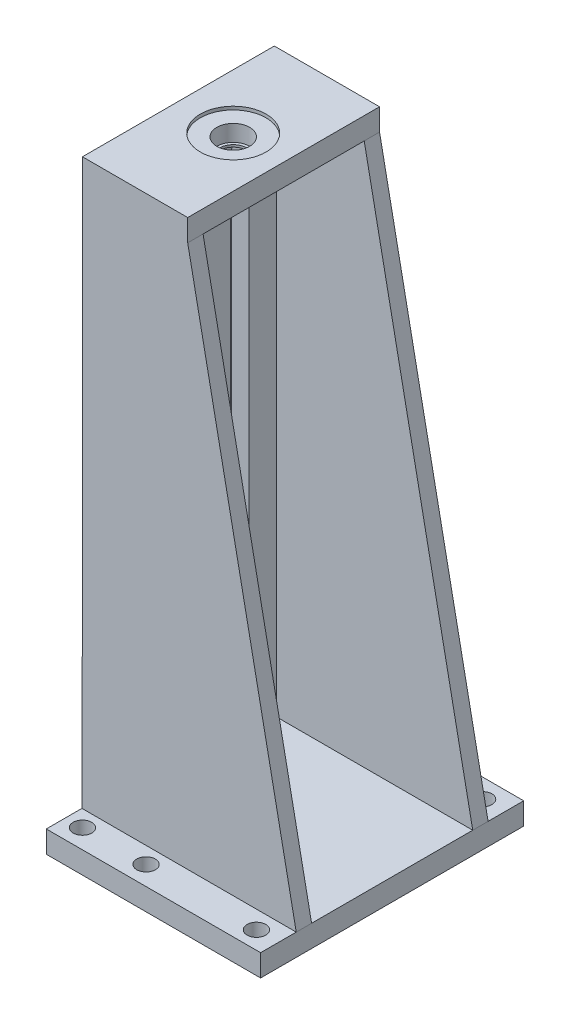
ISO-10303-21;
HEADER;
FILE_DESCRIPTION(('STEP AP214'),'2;1');
FILE_NAME('part.step','',(''),(''),'','','');
FILE_SCHEMA(('AUTOMOTIVE_DESIGN { 1 0 10303 214 1 1 1 1 }'));
ENDSEC;
DATA;
#1=APPLICATION_CONTEXT('core data for automotive mechanical design processes');
#2=APPLICATION_PROTOCOL_DEFINITION('international standard','automotive_design',2000,#1);
#3=PRODUCT_CONTEXT('',#1,'mechanical');
#4=PRODUCT('Part','Part','',(#3));
#5=PRODUCT_RELATED_PRODUCT_CATEGORY('part','',(#4));
#6=PRODUCT_DEFINITION_FORMATION('','',#4);
#7=PRODUCT_DEFINITION_CONTEXT('part definition',#1,'design');
#8=PRODUCT_DEFINITION('design','',#6,#7);
#9=PRODUCT_DEFINITION_SHAPE('','',#8);
#10=(LENGTH_UNIT() NAMED_UNIT(*) SI_UNIT(.MILLI.,.METRE.));
#11=(NAMED_UNIT(*) PLANE_ANGLE_UNIT() SI_UNIT($,.RADIAN.));
#12=(NAMED_UNIT(*) SI_UNIT($,.STERADIAN.) SOLID_ANGLE_UNIT());
#13=UNCERTAINTY_MEASURE_WITH_UNIT(LENGTH_MEASURE(1.E-05),#10,'distance_accuracy_value','');
#14=(GEOMETRIC_REPRESENTATION_CONTEXT(3) GLOBAL_UNCERTAINTY_ASSIGNED_CONTEXT((#13)) GLOBAL_UNIT_ASSIGNED_CONTEXT((#10,
#11,#12)) REPRESENTATION_CONTEXT('',''));
#15=CARTESIAN_POINT('',(0.,0.,0.));
#16=DIRECTION('',(0.,0.,1.));
#17=DIRECTION('',(1.,0.,0.));
#18=AXIS2_PLACEMENT_3D('',#15,#16,#17);
#19=CARTESIAN_POINT('',(50.,532.,0.));
#20=DIRECTION('',(0.,1.,0.));
#21=DIRECTION('',(0.,0.,1.));
#22=AXIS2_PLACEMENT_3D('',#19,#20,#21);
#23=CYLINDRICAL_SURFACE('',#22,15.);
#24=CARTESIAN_POINT('',(50.,517.,0.));
#25=DIRECTION('',(0.,1.,0.));
#26=DIRECTION('',(0.,0.,1.));
#27=AXIS2_PLACEMENT_3D('',#24,#25,#26);
#28=CIRCLE('',#27,15.);
#29=CARTESIAN_POINT('',(50.,517.,15.));
#30=VERTEX_POINT('',#29);
#31=EDGE_CURVE('E20',#30,#30,#28,.T.);
#32=ORIENTED_EDGE('',*,*,#31,.F.);
#33=EDGE_LOOP('',(#32));
#34=FACE_BOUND('',#33,.T.);
#35=CARTESIAN_POINT('',(50.,532.,0.));
#36=DIRECTION('',(0.,1.,0.));
#37=DIRECTION('',(0.,0.,1.));
#38=AXIS2_PLACEMENT_3D('',#35,#36,#37);
#39=CIRCLE('',#38,15.);
#40=CARTESIAN_POINT('',(50.,532.,15.));
#41=VERTEX_POINT('',#40);
#42=EDGE_CURVE('E384',#41,#41,#39,.F.);
#43=ORIENTED_EDGE('',*,*,#42,.F.);
#44=EDGE_LOOP('',(#43));
#45=FACE_BOUND('',#44,.T.);
#46=ADVANCED_FACE('F17',(#34,#45),#23,.F.);
#47=CARTESIAN_POINT('',(0.,517.,-120.));
#48=DIRECTION('',(0.,1.,0.));
#49=DIRECTION('',(0.,0.,1.));
#50=AXIS2_PLACEMENT_3D('',#47,#48,#49);
#51=PLANE('',#50);
#52=CARTESIAN_POINT('',(50.,517.,0.));
#53=DIRECTION('',(0.,1.,0.));
#54=DIRECTION('',(0.,0.,1.));
#55=AXIS2_PLACEMENT_3D('',#52,#53,#54);
#56=CIRCLE('',#55,12.5);
#57=CARTESIAN_POINT('',(50.,517.,12.5));
#58=VERTEX_POINT('',#57);
#59=EDGE_CURVE('E304',#58,#58,#56,.F.);
#60=ORIENTED_EDGE('',*,*,#59,.T.);
#61=EDGE_LOOP('',(#60));
#62=FACE_BOUND('',#61,.T.);
#63=ORIENTED_EDGE('',*,*,#31,.T.);
#64=EDGE_LOOP('',(#63));
#65=FACE_BOUND('',#64,.T.);
#66=ADVANCED_FACE('F391',(#62,#65),#51,.T.);
#67=CARTESIAN_POINT('',(0.,532.,-120.));
#68=DIRECTION('',(0.,1.,0.));
#69=DIRECTION('',(0.,0.,1.));
#70=AXIS2_PLACEMENT_3D('',#67,#68,#69);
#71=PLANE('',#70);
#72=ORIENTED_EDGE('',*,*,#42,.T.);
#73=EDGE_LOOP('',(#72));
#74=FACE_BOUND('',#73,.T.);
#75=CARTESIAN_POINT('',(50.,532.,0.));
#76=DIRECTION('',(0.,1.,0.));
#77=DIRECTION('',(0.,0.,1.));
#78=AXIS2_PLACEMENT_3D('',#75,#76,#77);
#79=CIRCLE('',#78,30.);
#80=CARTESIAN_POINT('',(50.,532.,30.));
#81=VERTEX_POINT('',#80);
#82=EDGE_CURVE('E277',#81,#81,#79,.T.);
#83=ORIENTED_EDGE('',*,*,#82,.T.);
#84=EDGE_LOOP('',(#83));
#85=FACE_BOUND('',#84,.T.);
#86=ADVANCED_FACE('F399',(#74,#85),#71,.T.);
#87=CARTESIAN_POINT('',(0.,20.,73.5));
#88=DIRECTION('',(0.,0.,1.));
#89=DIRECTION('',(1.,0.,0.));
#90=AXIS2_PLACEMENT_3D('',#87,#88,#89);
#91=PLANE('',#90);
#92=DIRECTION('',(1.,0.,0.));
#93=VECTOR('',#92,1.);
#94=CARTESIAN_POINT('',(0.,20.,73.5));
#95=LINE('',#94,#93);
#96=CARTESIAN_POINT('',(16.,20.,73.5));
#97=VERTEX_POINT('',#96);
#98=CARTESIAN_POINT('',(195.,20.,73.5));
#99=VERTEX_POINT('',#98);
#100=EDGE_CURVE('E296',#97,#99,#95,.T.);
#101=ORIENTED_EDGE('',*,*,#100,.F.);
#102=DIRECTION('',(0.,1.,0.));
#103=VECTOR('',#102,1.);
#104=CARTESIAN_POINT('',(16.,0.,73.5));
#105=LINE('',#104,#103);
#106=CARTESIAN_POINT('',(16.,515.,73.5));
#107=VERTEX_POINT('',#106);
#108=EDGE_CURVE('E291',#97,#107,#105,.T.);
#109=ORIENTED_EDGE('',*,*,#108,.T.);
#110=DIRECTION('',(1.,0.,0.));
#111=VECTOR('',#110,1.);
#112=CARTESIAN_POINT('',(0.,515.,73.5));
#113=LINE('',#112,#111);
#114=CARTESIAN_POINT('',(95.9999999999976,514.999999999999,73.5));
#115=VERTEX_POINT('',#114);
#116=EDGE_CURVE('E269',#107,#115,#113,.T.);
#117=ORIENTED_EDGE('',*,*,#116,.T.);
#118=DIRECTION('',(-0.196116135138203,0.980580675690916,0.));
#119=VECTOR('',#118,1.);
#120=CARTESIAN_POINT('',(195.,20.,73.5));
#121=LINE('',#120,#119);
#122=EDGE_CURVE('E274',#99,#115,#121,.T.);
#123=ORIENTED_EDGE('',*,*,#122,.F.);
#124=EDGE_LOOP('',(#101,#109,#117,#123));
#125=FACE_BOUND('',#124,.T.);
#126=ADVANCED_FACE('F557',(#125),#91,.F.);
#127=CARTESIAN_POINT('',(50.,532.,0.));
#128=DIRECTION('',(0.,1.,0.));
#129=DIRECTION('',(0.,0.,1.));
#130=AXIS2_PLACEMENT_3D('',#127,#128,#129);
#131=CYLINDRICAL_SURFACE('',#130,12.5);
#132=ORIENTED_EDGE('',*,*,#59,.F.);
#133=EDGE_LOOP('',(#132));
#134=FACE_BOUND('',#133,.T.);
#135=CARTESIAN_POINT('',(50.,515.,0.));
#136=DIRECTION('',(0.,1.,0.));
#137=DIRECTION('',(0.,0.,1.));
#138=AXIS2_PLACEMENT_3D('',#135,#136,#137);
#139=CIRCLE('',#138,12.5);
#140=CARTESIAN_POINT('',(50.,515.,12.5));
#141=VERTEX_POINT('',#140);
#142=EDGE_CURVE('E268',#141,#141,#139,.F.);
#143=ORIENTED_EDGE('',*,*,#142,.T.);
#144=EDGE_LOOP('',(#143));
#145=FACE_BOUND('',#144,.T.);
#146=ADVANCED_FACE('F553',(#134,#145),#131,.F.);
#147=CARTESIAN_POINT('',(0.,20.,0.));
#148=DIRECTION('',(0.,1.,0.));
#149=DIRECTION('',(0.,0.,1.));
#150=AXIS2_PLACEMENT_3D('',#147,#148,#149);
#151=PLANE('',#150);
#152=DIRECTION('',(0.,0.,-1.));
#153=VECTOR('',#152,1.);
#154=CARTESIAN_POINT('',(195.,20.,120.));
#155=LINE('',#154,#153);
#156=CARTESIAN_POINT('',(195.,20.,-73.5));
#157=VERTEX_POINT('',#156);
#158=EDGE_CURVE('E254',#157,#99,#155,.F.);
#159=ORIENTED_EDGE('',*,*,#158,.F.);
#160=DIRECTION('',(1.,0.,0.));
#161=VECTOR('',#160,1.);
#162=CARTESIAN_POINT('',(0.,20.,-73.5));
#163=LINE('',#162,#161);
#164=CARTESIAN_POINT('',(16.,20.,-73.5));
#165=VERTEX_POINT('',#164);
#166=EDGE_CURVE('E262',#165,#157,#163,.T.);
#167=ORIENTED_EDGE('',*,*,#166,.F.);
#168=DIRECTION('',(0.,0.,1.));
#169=VECTOR('',#168,1.);
#170=CARTESIAN_POINT('',(16.,20.,0.));
#171=LINE('',#170,#169);
#172=EDGE_CURVE('E293',#165,#97,#171,.T.);
#173=ORIENTED_EDGE('',*,*,#172,.T.);
#174=ORIENTED_EDGE('',*,*,#100,.T.);
#175=EDGE_LOOP('',(#159,#167,#173,#174));
#176=FACE_BOUND('',#175,.T.);
#177=ADVANCED_FACE('F549',(#176),#151,.T.);
#178=CARTESIAN_POINT('',(73.,20.,102.5));
#179=DIRECTION('',(0.,1.,0.));
#180=DIRECTION('',(0.,0.,1.));
#181=AXIS2_PLACEMENT_3D('',#178,#179,#180);
#182=CYLINDRICAL_SURFACE('',#181,8.5);
#183=CARTESIAN_POINT('',(73.,20.,102.5));
#184=DIRECTION('',(0.,1.,0.));
#185=DIRECTION('',(0.,0.,1.));
#186=AXIS2_PLACEMENT_3D('',#183,#184,#185);
#187=CIRCLE('',#186,8.5);
#188=CARTESIAN_POINT('',(73.,20.,111.));
#189=VERTEX_POINT('',#188);
#190=EDGE_CURVE('E247',#189,#189,#187,.F.);
#191=ORIENTED_EDGE('',*,*,#190,.F.);
#192=EDGE_LOOP('',(#191));
#193=FACE_BOUND('',#192,.T.);
#194=CARTESIAN_POINT('',(73.,0.,102.5));
#195=DIRECTION('',(0.,1.,0.));
#196=DIRECTION('',(0.,0.,1.));
#197=AXIS2_PLACEMENT_3D('',#194,#195,#196);
#198=CIRCLE('',#197,8.5);
#199=CARTESIAN_POINT('',(73.,0.,111.));
#200=VERTEX_POINT('',#199);
#201=EDGE_CURVE('E367',#200,#200,#198,.F.);
#202=ORIENTED_EDGE('',*,*,#201,.T.);
#203=EDGE_LOOP('',(#202));
#204=FACE_BOUND('',#203,.T.);
#205=ADVANCED_FACE('F545',(#193,#204),#182,.F.);
#206=CARTESIAN_POINT('',(15.,20.,102.5));
#207=DIRECTION('',(0.,1.,0.));
#208=DIRECTION('',(0.,0.,1.));
#209=AXIS2_PLACEMENT_3D('',#206,#207,#208);
#210=CYLINDRICAL_SURFACE('',#209,8.5);
#211=CARTESIAN_POINT('',(15.,20.,102.5));
#212=DIRECTION('',(0.,1.,0.));
#213=DIRECTION('',(0.,0.,1.));
#214=AXIS2_PLACEMENT_3D('',#211,#212,#213);
#215=CIRCLE('',#214,8.5);
#216=CARTESIAN_POINT('',(15.,20.,111.));
#217=VERTEX_POINT('',#216);
#218=EDGE_CURVE('E374',#217,#217,#215,.F.);
#219=ORIENTED_EDGE('',*,*,#218,.F.);
#220=EDGE_LOOP('',(#219));
#221=FACE_BOUND('',#220,.T.);
#222=CARTESIAN_POINT('',(15.,0.,102.5));
#223=DIRECTION('',(0.,1.,0.));
#224=DIRECTION('',(0.,0.,1.));
#225=AXIS2_PLACEMENT_3D('',#222,#223,#224);
#226=CIRCLE('',#225,8.5);
#227=CARTESIAN_POINT('',(15.,0.,111.));
#228=VERTEX_POINT('',#227);
#229=EDGE_CURVE('E361',#228,#228,#226,.F.);
#230=ORIENTED_EDGE('',*,*,#229,.T.);
#231=EDGE_LOOP('',(#230));
#232=FACE_BOUND('',#231,.T.);
#233=ADVANCED_FACE('F541',(#221,#232),#210,.F.);
#234=CARTESIAN_POINT('',(175.,20.,103.8173209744));
#235=DIRECTION('',(0.,1.,0.));
#236=DIRECTION('',(0.,0.,1.));
#237=AXIS2_PLACEMENT_3D('',#234,#235,#236);
#238=CYLINDRICAL_SURFACE('',#237,8.5);
#239=CARTESIAN_POINT('',(175.,20.,103.8173209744));
#240=DIRECTION('',(0.,1.,0.));
#241=DIRECTION('',(0.,0.,1.));
#242=AXIS2_PLACEMENT_3D('',#239,#240,#241);
#243=CIRCLE('',#242,8.5);
#244=CARTESIAN_POINT('',(175.,20.,112.3173209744));
#245=VERTEX_POINT('',#244);
#246=EDGE_CURVE('E243',#245,#245,#243,.F.);
#247=ORIENTED_EDGE('',*,*,#246,.F.);
#248=EDGE_LOOP('',(#247));
#249=FACE_BOUND('',#248,.T.);
#250=CARTESIAN_POINT('',(175.,0.,103.8173209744));
#251=DIRECTION('',(0.,1.,0.));
#252=DIRECTION('',(0.,0.,1.));
#253=AXIS2_PLACEMENT_3D('',#250,#251,#252);
#254=CIRCLE('',#253,8.5);
#255=CARTESIAN_POINT('',(175.,0.,112.3173209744));
#256=VERTEX_POINT('',#255);
#257=EDGE_CURVE('E231',#256,#256,#254,.F.);
#258=ORIENTED_EDGE('',*,*,#257,.T.);
#259=EDGE_LOOP('',(#258));
#260=FACE_BOUND('',#259,.T.);
#261=ADVANCED_FACE('F537',(#249,#260),#238,.F.);
#262=CARTESIAN_POINT('',(16.,0.,0.));
#263=DIRECTION('',(-1.,0.,0.));
#264=DIRECTION('',(0.,0.,1.));
#265=AXIS2_PLACEMENT_3D('',#262,#263,#264);
#266=PLANE('',#265);
#267=CARTESIAN_POINT('',(16.,185.,-40.));
#268=DIRECTION('',(-1.,0.,0.));
#269=DIRECTION('',(0.,0.,1.));
#270=AXIS2_PLACEMENT_3D('',#267,#268,#269);
#271=CIRCLE('',#270,8.5);
#272=CARTESIAN_POINT('',(16.,185.,-48.5));
#273=VERTEX_POINT('',#272);
#274=CARTESIAN_POINT('',(16.,185.,-31.5));
#275=VERTEX_POINT('',#274);
#276=EDGE_CURVE('E299',#273,#275,#271,.T.);
#277=ORIENTED_EDGE('',*,*,#276,.T.);
#278=DIRECTION('',(0.,1.,0.));
#279=VECTOR('',#278,1.);
#280=CARTESIAN_POINT('',(16.,185.,-31.5));
#281=LINE('',#280,#279);
#282=CARTESIAN_POINT('',(16.,485.,-31.5));
#283=VERTEX_POINT('',#282);
#284=EDGE_CURVE('E297',#283,#275,#281,.F.);
#285=ORIENTED_EDGE('',*,*,#284,.F.);
#286=CARTESIAN_POINT('',(16.,485.,-40.));
#287=DIRECTION('',(-1.,0.,0.));
#288=DIRECTION('',(0.,0.,1.));
#289=AXIS2_PLACEMENT_3D('',#286,#287,#288);
#290=CIRCLE('',#289,8.5);
#291=CARTESIAN_POINT('',(16.,485.,-48.5));
#292=VERTEX_POINT('',#291);
#293=EDGE_CURVE('E350',#283,#292,#290,.T.);
#294=ORIENTED_EDGE('',*,*,#293,.T.);
#295=DIRECTION('',(0.,1.,0.));
#296=VECTOR('',#295,1.);
#297=CARTESIAN_POINT('',(16.,485.,-48.5));
#298=LINE('',#297,#296);
#299=EDGE_CURVE('E286',#273,#292,#298,.T.);
#300=ORIENTED_EDGE('',*,*,#299,.F.);
#301=EDGE_LOOP('',(#277,#285,#294,#300));
#302=FACE_BOUND('',#301,.T.);
#303=CARTESIAN_POINT('',(16.,185.,40.));
#304=DIRECTION('',(1.,0.,0.));
#305=DIRECTION('',(0.,0.,-1.));
#306=AXIS2_PLACEMENT_3D('',#303,#304,#305);
#307=CIRCLE('',#306,8.5);
#308=CARTESIAN_POINT('',(16.,185.,31.5));
#309=VERTEX_POINT('',#308);
#310=CARTESIAN_POINT('',(16.,185.,48.5));
#311=VERTEX_POINT('',#310);
#312=EDGE_CURVE('E194',#309,#311,#307,.F.);
#313=ORIENTED_EDGE('',*,*,#312,.T.);
#314=DIRECTION('',(0.,1.,0.));
#315=VECTOR('',#314,1.);
#316=CARTESIAN_POINT('',(16.,485.,48.5));
#317=LINE('',#316,#315);
#318=CARTESIAN_POINT('',(16.,485.,48.5));
#319=VERTEX_POINT('',#318);
#320=EDGE_CURVE('E198',#311,#319,#317,.T.);
#321=ORIENTED_EDGE('',*,*,#320,.T.);
#322=CARTESIAN_POINT('',(16.,485.,40.));
#323=DIRECTION('',(1.,0.,0.));
#324=DIRECTION('',(0.,0.,-1.));
#325=AXIS2_PLACEMENT_3D('',#322,#323,#324);
#326=CIRCLE('',#325,8.5);
#327=CARTESIAN_POINT('',(16.,485.,31.5));
#328=VERTEX_POINT('',#327);
#329=EDGE_CURVE('E354',#319,#328,#326,.F.);
#330=ORIENTED_EDGE('',*,*,#329,.T.);
#331=DIRECTION('',(0.,1.,0.));
#332=VECTOR('',#331,1.);
#333=CARTESIAN_POINT('',(16.,185.,31.5));
#334=LINE('',#333,#332);
#335=EDGE_CURVE('E192',#328,#309,#334,.F.);
#336=ORIENTED_EDGE('',*,*,#335,.T.);
#337=EDGE_LOOP('',(#313,#321,#330,#336));
#338=FACE_BOUND('',#337,.T.);
#339=ORIENTED_EDGE('',*,*,#108,.F.);
#340=ORIENTED_EDGE('',*,*,#172,.F.);
#341=DIRECTION('',(0.,1.,0.));
#342=VECTOR('',#341,1.);
#343=CARTESIAN_POINT('',(16.,20.,-73.5));
#344=LINE('',#343,#342);
#345=CARTESIAN_POINT('',(16.,515.,-73.5));
#346=VERTEX_POINT('',#345);
#347=EDGE_CURVE('E265',#346,#165,#344,.F.);
#348=ORIENTED_EDGE('',*,*,#347,.F.);
#349=DIRECTION('',(0.,0.,1.));
#350=VECTOR('',#349,1.);
#351=CARTESIAN_POINT('',(16.,515.,0.));
#352=LINE('',#351,#350);
#353=EDGE_CURVE('E271',#346,#107,#352,.T.);
#354=ORIENTED_EDGE('',*,*,#353,.T.);
#355=EDGE_LOOP('',(#339,#340,#348,#354));
#356=FACE_BOUND('',#355,.T.);
#357=ADVANCED_FACE('F196',(#302,#338,#356),#266,.F.);
#358=CARTESIAN_POINT('',(-5.,0.,0.));
#359=DIRECTION('',(-1.,0.,0.));
#360=DIRECTION('',(0.,0.,1.));
#361=AXIS2_PLACEMENT_3D('',#358,#359,#360);
#362=PLANE('',#361);
#363=DIRECTION('',(0.,1.,0.));
#364=VECTOR('',#363,1.);
#365=CARTESIAN_POINT('',(-5.,220.,8.));
#366=LINE('',#365,#364);
#367=CARTESIAN_POINT('',(-5.,454.,8.));
#368=VERTEX_POINT('',#367);
#369=CARTESIAN_POINT('',(-5.,220.,8.));
#370=VERTEX_POINT('',#369);
#371=EDGE_CURVE('E278',#368,#370,#366,.F.);
#372=ORIENTED_EDGE('',*,*,#371,.F.);
#373=CARTESIAN_POINT('',(-5.,454.,0.));
#374=DIRECTION('',(-1.,0.,0.));
#375=DIRECTION('',(0.,0.,1.));
#376=AXIS2_PLACEMENT_3D('',#373,#374,#375);
#377=CIRCLE('',#376,8.);
#378=CARTESIAN_POINT('',(-5.,454.,-8.));
#379=VERTEX_POINT('',#378);
#380=EDGE_CURVE('E344',#379,#368,#377,.F.);
#381=ORIENTED_EDGE('',*,*,#380,.F.);
#382=DIRECTION('',(0.,1.,0.));
#383=VECTOR('',#382,1.);
#384=CARTESIAN_POINT('',(-5.,454.,-8.));
#385=LINE('',#384,#383);
#386=CARTESIAN_POINT('',(-5.,220.,-8.));
#387=VERTEX_POINT('',#386);
#388=EDGE_CURVE('E282',#387,#379,#385,.T.);
#389=ORIENTED_EDGE('',*,*,#388,.F.);
#390=CARTESIAN_POINT('',(-5.,220.,0.));
#391=DIRECTION('',(-1.,0.,0.));
#392=DIRECTION('',(0.,0.,1.));
#393=AXIS2_PLACEMENT_3D('',#390,#391,#392);
#394=CIRCLE('',#393,8.);
#395=EDGE_CURVE('E348',#370,#387,#394,.F.);
#396=ORIENTED_EDGE('',*,*,#395,.F.);
#397=EDGE_LOOP('',(#372,#381,#389,#396));
#398=FACE_BOUND('',#397,.T.);
#399=ADVANCED_FACE('F530',(#398),#362,.T.);
#400=CARTESIAN_POINT('',(50.,535.,0.));
#401=DIRECTION('',(0.,1.,0.));
#402=DIRECTION('',(0.,0.,1.));
#403=AXIS2_PLACEMENT_3D('',#400,#401,#402);
#404=CYLINDRICAL_SURFACE('',#403,30.);
#405=ORIENTED_EDGE('',*,*,#82,.F.);
#406=EDGE_LOOP('',(#405));
#407=FACE_BOUND('',#406,.T.);
#408=CARTESIAN_POINT('',(50.,535.,0.));
#409=DIRECTION('',(0.,1.,0.));
#410=DIRECTION('',(0.,0.,1.));
#411=AXIS2_PLACEMENT_3D('',#408,#409,#410);
#412=CIRCLE('',#411,30.);
#413=CARTESIAN_POINT('',(50.,535.,30.));
#414=VERTEX_POINT('',#413);
#415=EDGE_CURVE('E339',#414,#414,#412,.F.);
#416=ORIENTED_EDGE('',*,*,#415,.F.);
#417=EDGE_LOOP('',(#416));
#418=FACE_BOUND('',#417,.T.);
#419=ADVANCED_FACE('F526',(#407,#418),#404,.F.);
#420=CARTESIAN_POINT('',(195.,20.,87.5));
#421=DIRECTION('',(0.980580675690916,0.196116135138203,0.));
#422=DIRECTION('',(-0.196116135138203,0.980580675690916,0.));
#423=AXIS2_PLACEMENT_3D('',#420,#421,#422);
#424=PLANE('',#423);
#425=ORIENTED_EDGE('',*,*,#122,.T.);
#426=DIRECTION('',(0.,0.,-1.));
#427=VECTOR('',#426,1.);
#428=CARTESIAN_POINT('',(96.,515.,87.5));
#429=LINE('',#428,#427);
#430=CARTESIAN_POINT('',(95.9999999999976,515.,87.5));
#431=VERTEX_POINT('',#430);
#432=EDGE_CURVE('E590',#431,#115,#429,.T.);
#433=ORIENTED_EDGE('',*,*,#432,.F.);
#434=DIRECTION('',(-0.196116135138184,0.98058067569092,0.));
#435=VECTOR('',#434,1.);
#436=CARTESIAN_POINT('',(195.,20.,87.5));
#437=LINE('',#436,#435);
#438=CARTESIAN_POINT('',(195.,20.,87.5));
#439=VERTEX_POINT('',#438);
#440=EDGE_CURVE('E229',#439,#431,#437,.T.);
#441=ORIENTED_EDGE('',*,*,#440,.F.);
#442=DIRECTION('',(0.,0.,-1.));
#443=VECTOR('',#442,1.);
#444=CARTESIAN_POINT('',(195.,20.,120.));
#445=LINE('',#444,#443);
#446=EDGE_CURVE('E257',#99,#439,#445,.F.);
#447=ORIENTED_EDGE('',*,*,#446,.F.);
#448=EDGE_LOOP('',(#425,#433,#441,#447));
#449=FACE_BOUND('',#448,.T.);
#450=ADVANCED_FACE('F522',(#449),#424,.T.);
#451=CARTESIAN_POINT('',(0.,515.,0.));
#452=DIRECTION('',(0.,1.,0.));
#453=DIRECTION('',(0.,0.,1.));
#454=AXIS2_PLACEMENT_3D('',#451,#452,#453);
#455=PLANE('',#454);
#456=ORIENTED_EDGE('',*,*,#142,.F.);
#457=EDGE_LOOP('',(#456));
#458=FACE_BOUND('',#457,.T.);
#459=DIRECTION('',(0.,0.,-1.));
#460=VECTOR('',#459,1.);
#461=CARTESIAN_POINT('',(96.,515.,87.5));
#462=LINE('',#461,#460);
#463=CARTESIAN_POINT('',(95.9999999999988,515.,-73.5));
#464=VERTEX_POINT('',#463);
#465=EDGE_CURVE('E585',#115,#464,#462,.T.);
#466=ORIENTED_EDGE('',*,*,#465,.F.);
#467=ORIENTED_EDGE('',*,*,#116,.F.);
#468=ORIENTED_EDGE('',*,*,#353,.F.);
#469=DIRECTION('',(1.,0.,0.));
#470=VECTOR('',#469,1.);
#471=CARTESIAN_POINT('',(0.,515.,-73.5));
#472=LINE('',#471,#470);
#473=EDGE_CURVE('E259',#464,#346,#472,.F.);
#474=ORIENTED_EDGE('',*,*,#473,.F.);
#475=EDGE_LOOP('',(#466,#467,#468,#474));
#476=FACE_BOUND('',#475,.T.);
#477=ADVANCED_FACE('F518',(#458,#476),#455,.F.);
#478=CARTESIAN_POINT('',(0.,20.,-73.5));
#479=DIRECTION('',(0.,0.,1.));
#480=DIRECTION('',(1.,0.,0.));
#481=AXIS2_PLACEMENT_3D('',#478,#479,#480);
#482=PLANE('',#481);
#483=DIRECTION('',(0.196116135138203,-0.980580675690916,0.));
#484=VECTOR('',#483,1.);
#485=CARTESIAN_POINT('',(195.,20.,-73.5));
#486=LINE('',#485,#484);
#487=EDGE_CURVE('E650',#157,#464,#486,.F.);
#488=ORIENTED_EDGE('',*,*,#487,.T.);
#489=ORIENTED_EDGE('',*,*,#473,.T.);
#490=ORIENTED_EDGE('',*,*,#347,.T.);
#491=ORIENTED_EDGE('',*,*,#166,.T.);
#492=EDGE_LOOP('',(#488,#489,#490,#491));
#493=FACE_BOUND('',#492,.T.);
#494=ADVANCED_FACE('F514',(#493),#482,.T.);
#495=CARTESIAN_POINT('',(195.,0.,120.));
#496=DIRECTION('',(1.,0.,0.));
#497=DIRECTION('',(0.,0.,-1.));
#498=AXIS2_PLACEMENT_3D('',#495,#496,#497);
#499=PLANE('',#498);
#500=DIRECTION('',(0.,0.,1.));
#501=VECTOR('',#500,1.);
#502=CARTESIAN_POINT('',(195.,20.,-87.5));
#503=LINE('',#502,#501);
#504=CARTESIAN_POINT('',(195.,20.,-87.5));
#505=VERTEX_POINT('',#504);
#506=EDGE_CURVE('E587',#505,#157,#503,.T.);
#507=ORIENTED_EDGE('',*,*,#506,.T.);
#508=ORIENTED_EDGE('',*,*,#158,.T.);
#509=ORIENTED_EDGE('',*,*,#446,.T.);
#510=DIRECTION('',(0.,0.,1.));
#511=VECTOR('',#510,1.);
#512=CARTESIAN_POINT('',(195.,20.,0.));
#513=LINE('',#512,#511);
#514=CARTESIAN_POINT('',(195.,20.,120.));
#515=VERTEX_POINT('',#514);
#516=EDGE_CURVE('E248',#515,#439,#513,.F.);
#517=ORIENTED_EDGE('',*,*,#516,.F.);
#518=DIRECTION('',(0.,1.,0.));
#519=VECTOR('',#518,1.);
#520=CARTESIAN_POINT('',(195.,0.,120.));
#521=LINE('',#520,#519);
#522=CARTESIAN_POINT('',(195.,0.,120.));
#523=VERTEX_POINT('',#522);
#524=EDGE_CURVE('E251',#523,#515,#521,.T.);
#525=ORIENTED_EDGE('',*,*,#524,.F.);
#526=DIRECTION('',(0.,0.,1.));
#527=VECTOR('',#526,1.);
#528=CARTESIAN_POINT('',(195.,0.,0.));
#529=LINE('',#528,#527);
#530=CARTESIAN_POINT('',(195.,0.,-120.));
#531=VERTEX_POINT('',#530);
#532=EDGE_CURVE('E232',#523,#531,#529,.F.);
#533=ORIENTED_EDGE('',*,*,#532,.T.);
#534=DIRECTION('',(0.,1.,0.));
#535=VECTOR('',#534,1.);
#536=CARTESIAN_POINT('',(195.,0.,-120.));
#537=LINE('',#536,#535);
#538=CARTESIAN_POINT('',(195.,20.,-120.));
#539=VERTEX_POINT('',#538);
#540=EDGE_CURVE('E241',#539,#531,#537,.F.);
#541=ORIENTED_EDGE('',*,*,#540,.F.);
#542=DIRECTION('',(0.,0.,1.));
#543=VECTOR('',#542,1.);
#544=CARTESIAN_POINT('',(195.,20.,0.));
#545=LINE('',#544,#543);
#546=EDGE_CURVE('E647',#505,#539,#545,.F.);
#547=ORIENTED_EDGE('',*,*,#546,.F.);
#548=EDGE_LOOP('',(#507,#508,#509,#517,#525,#533,#541,#547));
#549=FACE_BOUND('',#548,.T.);
#550=ADVANCED_FACE('F510',(#549),#499,.T.);
#551=CARTESIAN_POINT('',(73.,20.,-102.5));
#552=DIRECTION('',(0.,1.,0.));
#553=DIRECTION('',(0.,0.,1.));
#554=AXIS2_PLACEMENT_3D('',#551,#552,#553);
#555=CYLINDRICAL_SURFACE('',#554,8.5);
#556=CARTESIAN_POINT('',(73.,20.,-102.5));
#557=DIRECTION('',(0.,1.,0.));
#558=DIRECTION('',(0.,0.,1.));
#559=AXIS2_PLACEMENT_3D('',#556,#557,#558);
#560=CIRCLE('',#559,8.5);
#561=CARTESIAN_POINT('',(73.,20.,-94.));
#562=VERTEX_POINT('',#561);
#563=EDGE_CURVE('E335',#562,#562,#560,.F.);
#564=ORIENTED_EDGE('',*,*,#563,.F.);
#565=EDGE_LOOP('',(#564));
#566=FACE_BOUND('',#565,.T.);
#567=CARTESIAN_POINT('',(73.,0.,-102.5));
#568=DIRECTION('',(0.,1.,0.));
#569=DIRECTION('',(0.,0.,1.));
#570=AXIS2_PLACEMENT_3D('',#567,#568,#569);
#571=CIRCLE('',#570,8.5);
#572=CARTESIAN_POINT('',(73.,0.,-94.));
#573=VERTEX_POINT('',#572);
#574=EDGE_CURVE('E235',#573,#573,#571,.F.);
#575=ORIENTED_EDGE('',*,*,#574,.T.);
#576=EDGE_LOOP('',(#575));
#577=FACE_BOUND('',#576,.T.);
#578=ADVANCED_FACE('F506',(#566,#577),#555,.F.);
#579=CARTESIAN_POINT('',(15.,20.,-102.5));
#580=DIRECTION('',(0.,1.,0.));
#581=DIRECTION('',(0.,0.,1.));
#582=AXIS2_PLACEMENT_3D('',#579,#580,#581);
#583=CYLINDRICAL_SURFACE('',#582,8.5);
#584=CARTESIAN_POINT('',(15.,20.,-102.5));
#585=DIRECTION('',(0.,1.,0.));
#586=DIRECTION('',(0.,0.,1.));
#587=AXIS2_PLACEMENT_3D('',#584,#585,#586);
#588=CIRCLE('',#587,8.5);
#589=CARTESIAN_POINT('',(15.,20.,-94.));
#590=VERTEX_POINT('',#589);
#591=EDGE_CURVE('E332',#590,#590,#588,.F.);
#592=ORIENTED_EDGE('',*,*,#591,.F.);
#593=EDGE_LOOP('',(#592));
#594=FACE_BOUND('',#593,.T.);
#595=CARTESIAN_POINT('',(15.,0.,-102.5));
#596=DIRECTION('',(0.,1.,0.));
#597=DIRECTION('',(0.,0.,1.));
#598=AXIS2_PLACEMENT_3D('',#595,#596,#597);
#599=CIRCLE('',#598,8.5);
#600=CARTESIAN_POINT('',(15.,0.,-94.));
#601=VERTEX_POINT('',#600);
#602=EDGE_CURVE('E364',#601,#601,#599,.F.);
#603=ORIENTED_EDGE('',*,*,#602,.T.);
#604=EDGE_LOOP('',(#603));
#605=FACE_BOUND('',#604,.T.);
#606=ADVANCED_FACE('F502',(#594,#605),#583,.F.);
#607=CARTESIAN_POINT('',(175.,20.,-102.5));
#608=DIRECTION('',(0.,1.,0.));
#609=DIRECTION('',(0.,0.,1.));
#610=AXIS2_PLACEMENT_3D('',#607,#608,#609);
#611=CYLINDRICAL_SURFACE('',#610,8.5);
#612=CARTESIAN_POINT('',(175.,20.,-102.5));
#613=DIRECTION('',(0.,1.,0.));
#614=DIRECTION('',(0.,0.,1.));
#615=AXIS2_PLACEMENT_3D('',#612,#613,#614);
#616=CIRCLE('',#615,8.5);
#617=CARTESIAN_POINT('',(175.,20.,-94.));
#618=VERTEX_POINT('',#617);
#619=EDGE_CURVE('E328',#618,#618,#616,.F.);
#620=ORIENTED_EDGE('',*,*,#619,.F.);
#621=EDGE_LOOP('',(#620));
#622=FACE_BOUND('',#621,.T.);
#623=CARTESIAN_POINT('',(175.,0.,-102.5));
#624=DIRECTION('',(0.,1.,0.));
#625=DIRECTION('',(0.,0.,1.));
#626=AXIS2_PLACEMENT_3D('',#623,#624,#625);
#627=CIRCLE('',#626,8.5);
#628=CARTESIAN_POINT('',(175.,0.,-94.));
#629=VERTEX_POINT('',#628);
#630=EDGE_CURVE('E358',#629,#629,#627,.F.);
#631=ORIENTED_EDGE('',*,*,#630,.T.);
#632=EDGE_LOOP('',(#631));
#633=FACE_BOUND('',#632,.T.);
#634=ADVANCED_FACE('F498',(#622,#633),#611,.F.);
#635=CARTESIAN_POINT('',(0.,0.,120.));
#636=DIRECTION('',(0.,0.,1.));
#637=DIRECTION('',(1.,0.,0.));
#638=AXIS2_PLACEMENT_3D('',#635,#636,#637);
#639=PLANE('',#638);
#640=DIRECTION('',(0.,1.,0.));
#641=VECTOR('',#640,1.);
#642=CARTESIAN_POINT('',(-0.5,0.,120.));
#643=LINE('',#642,#641);
#644=CARTESIAN_POINT('',(-0.5,0.,120.));
#645=VERTEX_POINT('',#644);
#646=CARTESIAN_POINT('',(-0.5,20.,120.));
#647=VERTEX_POINT('',#646);
#648=EDGE_CURVE('E331',#645,#647,#643,.T.);
#649=ORIENTED_EDGE('',*,*,#648,.F.);
#650=DIRECTION('',(1.,0.,0.));
#651=VECTOR('',#650,1.);
#652=CARTESIAN_POINT('',(0.,0.,120.));
#653=LINE('',#652,#651);
#654=EDGE_CURVE('E236',#645,#523,#653,.T.);
#655=ORIENTED_EDGE('',*,*,#654,.T.);
#656=ORIENTED_EDGE('',*,*,#524,.T.);
#657=DIRECTION('',(1.,0.,0.));
#658=VECTOR('',#657,1.);
#659=CARTESIAN_POINT('',(0.,20.,120.));
#660=LINE('',#659,#658);
#661=EDGE_CURVE('E244',#647,#515,#660,.T.);
#662=ORIENTED_EDGE('',*,*,#661,.F.);
#663=EDGE_LOOP('',(#649,#655,#656,#662));
#664=FACE_BOUND('',#663,.T.);
#665=ADVANCED_FACE('F494',(#664),#639,.T.);
#666=CARTESIAN_POINT('',(0.,20.,0.));
#667=DIRECTION('',(0.,1.,0.));
#668=DIRECTION('',(0.,0.,1.));
#669=AXIS2_PLACEMENT_3D('',#666,#667,#668);
#670=PLANE('',#669);
#671=ORIENTED_EDGE('',*,*,#246,.T.);
#672=EDGE_LOOP('',(#671));
#673=FACE_BOUND('',#672,.T.);
#674=ORIENTED_EDGE('',*,*,#218,.T.);
#675=EDGE_LOOP('',(#674));
#676=FACE_BOUND('',#675,.T.);
#677=ORIENTED_EDGE('',*,*,#190,.T.);
#678=EDGE_LOOP('',(#677));
#679=FACE_BOUND('',#678,.T.);
#680=DIRECTION('',(0.,0.,1.));
#681=VECTOR('',#680,1.);
#682=CARTESIAN_POINT('',(-0.5,20.,0.));
#683=LINE('',#682,#681);
#684=CARTESIAN_POINT('',(-0.5,20.,87.5));
#685=VERTEX_POINT('',#684);
#686=EDGE_CURVE('E641',#647,#685,#683,.F.);
#687=ORIENTED_EDGE('',*,*,#686,.F.);
#688=ORIENTED_EDGE('',*,*,#661,.T.);
#689=ORIENTED_EDGE('',*,*,#516,.T.);
#690=DIRECTION('',(1.,0.,0.));
#691=VECTOR('',#690,1.);
#692=CARTESIAN_POINT('',(0.,20.,87.5));
#693=LINE('',#692,#691);
#694=EDGE_CURVE('E226',#685,#439,#693,.T.);
#695=ORIENTED_EDGE('',*,*,#694,.F.);
#696=EDGE_LOOP('',(#687,#688,#689,#695));
#697=FACE_BOUND('',#696,.T.);
#698=ADVANCED_FACE('F490',(#673,#676,#679,#697),#670,.T.);
#699=CARTESIAN_POINT('',(195.,0.,-120.));
#700=DIRECTION('',(0.,0.,-1.));
#701=DIRECTION('',(-1.,0.,0.));
#702=AXIS2_PLACEMENT_3D('',#699,#700,#701);
#703=PLANE('',#702);
#704=DIRECTION('',(0.,1.,0.));
#705=VECTOR('',#704,1.);
#706=CARTESIAN_POINT('',(-0.5,0.,-120.));
#707=LINE('',#706,#705);
#708=CARTESIAN_POINT('',(-0.5,20.,-120.));
#709=VERTEX_POINT('',#708);
#710=CARTESIAN_POINT('',(-0.5,0.,-120.));
#711=VERTEX_POINT('',#710);
#712=EDGE_CURVE('E629',#709,#711,#707,.F.);
#713=ORIENTED_EDGE('',*,*,#712,.F.);
#714=DIRECTION('',(1.,0.,0.));
#715=VECTOR('',#714,1.);
#716=CARTESIAN_POINT('',(0.,20.,-120.));
#717=LINE('',#716,#715);
#718=EDGE_CURVE('E338',#539,#709,#717,.F.);
#719=ORIENTED_EDGE('',*,*,#718,.F.);
#720=ORIENTED_EDGE('',*,*,#540,.T.);
#721=DIRECTION('',(1.,0.,0.));
#722=VECTOR('',#721,1.);
#723=CARTESIAN_POINT('',(0.,0.,-120.));
#724=LINE('',#723,#722);
#725=EDGE_CURVE('E239',#531,#711,#724,.F.);
#726=ORIENTED_EDGE('',*,*,#725,.T.);
#727=EDGE_LOOP('',(#713,#719,#720,#726));
#728=FACE_BOUND('',#727,.T.);
#729=ADVANCED_FACE('F486',(#728),#703,.T.);
#730=CARTESIAN_POINT('',(0.,0.,0.));
#731=DIRECTION('',(0.,1.,0.));
#732=DIRECTION('',(0.,0.,1.));
#733=AXIS2_PLACEMENT_3D('',#730,#731,#732);
#734=PLANE('',#733);
#735=ORIENTED_EDGE('',*,*,#257,.F.);
#736=EDGE_LOOP('',(#735));
#737=FACE_BOUND('',#736,.T.);
#738=ORIENTED_EDGE('',*,*,#630,.F.);
#739=EDGE_LOOP('',(#738));
#740=FACE_BOUND('',#739,.T.);
#741=ORIENTED_EDGE('',*,*,#229,.F.);
#742=EDGE_LOOP('',(#741));
#743=FACE_BOUND('',#742,.T.);
#744=ORIENTED_EDGE('',*,*,#602,.F.);
#745=EDGE_LOOP('',(#744));
#746=FACE_BOUND('',#745,.T.);
#747=ORIENTED_EDGE('',*,*,#201,.F.);
#748=EDGE_LOOP('',(#747));
#749=FACE_BOUND('',#748,.T.);
#750=ORIENTED_EDGE('',*,*,#574,.F.);
#751=EDGE_LOOP('',(#750));
#752=FACE_BOUND('',#751,.T.);
#753=ORIENTED_EDGE('',*,*,#654,.F.);
#754=DIRECTION('',(0.,0.,1.));
#755=VECTOR('',#754,1.);
#756=CARTESIAN_POINT('',(-0.5,0.,0.));
#757=LINE('',#756,#755);
#758=EDGE_CURVE('E626',#711,#645,#757,.T.);
#759=ORIENTED_EDGE('',*,*,#758,.F.);
#760=ORIENTED_EDGE('',*,*,#725,.F.);
#761=ORIENTED_EDGE('',*,*,#532,.F.);
#762=EDGE_LOOP('',(#753,#759,#760,#761));
#763=FACE_BOUND('',#762,.T.);
#764=ADVANCED_FACE('F482',(#737,#740,#743,#746,#749,#752,#763),#734,.F.);
#765=CARTESIAN_POINT('',(0.,20.,87.5));
#766=DIRECTION('',(0.,0.,1.));
#767=DIRECTION('',(1.,0.,0.));
#768=AXIS2_PLACEMENT_3D('',#765,#766,#767);
#769=PLANE('',#768);
#770=DIRECTION('',(0.,1.,0.));
#771=VECTOR('',#770,1.);
#772=CARTESIAN_POINT('',(-0.5,0.,87.5));
#773=LINE('',#772,#771);
#774=CARTESIAN_POINT('',(-0.5,140.,87.5));
#775=VERTEX_POINT('',#774);
#776=EDGE_CURVE('E638',#685,#775,#773,.T.);
#777=ORIENTED_EDGE('',*,*,#776,.F.);
#778=ORIENTED_EDGE('',*,*,#694,.T.);
#779=ORIENTED_EDGE('',*,*,#440,.T.);
#780=DIRECTION('',(0.,1.,0.));
#781=VECTOR('',#780,1.);
#782=CARTESIAN_POINT('',(96.,515.,87.5));
#783=LINE('',#782,#781);
#784=CARTESIAN_POINT('',(96.,535.,87.5));
#785=VERTEX_POINT('',#784);
#786=EDGE_CURVE('E342',#785,#431,#783,.F.);
#787=ORIENTED_EDGE('',*,*,#786,.F.);
#788=DIRECTION('',(1.,0.,0.));
#789=VECTOR('',#788,1.);
#790=CARTESIAN_POINT('',(0.,535.,87.5));
#791=LINE('',#790,#789);
#792=CARTESIAN_POINT('',(0.,535.,87.5));
#793=VERTEX_POINT('',#792);
#794=EDGE_CURVE('E343',#793,#785,#791,.T.);
#795=ORIENTED_EDGE('',*,*,#794,.F.);
#796=DIRECTION('',(0.,1.,0.));
#797=VECTOR('',#796,1.);
#798=CARTESIAN_POINT('',(0.,0.,87.5));
#799=LINE('',#798,#797);
#800=CARTESIAN_POINT('',(0.,140.,87.5));
#801=VERTEX_POINT('',#800);
#802=EDGE_CURVE('E624',#801,#793,#799,.T.);
#803=ORIENTED_EDGE('',*,*,#802,.F.);
#804=DIRECTION('',(1.,0.,0.));
#805=VECTOR('',#804,1.);
#806=CARTESIAN_POINT('',(0.,140.,87.5));
#807=LINE('',#806,#805);
#808=EDGE_CURVE('E211',#775,#801,#807,.T.);
#809=ORIENTED_EDGE('',*,*,#808,.F.);
#810=EDGE_LOOP('',(#777,#778,#779,#787,#795,#803,#809));
#811=FACE_BOUND('',#810,.T.);
#812=ADVANCED_FACE('F478',(#811),#769,.T.);
#813=CARTESIAN_POINT('',(0.,140.,87.5));
#814=DIRECTION('',(0.,1.,0.));
#815=DIRECTION('',(0.,0.,1.));
#816=AXIS2_PLACEMENT_3D('',#813,#814,#815);
#817=PLANE('',#816);
#818=ORIENTED_EDGE('',*,*,#808,.T.);
#819=DIRECTION('',(0.,0.,1.));
#820=VECTOR('',#819,1.);
#821=CARTESIAN_POINT('',(0.,140.,-120.));
#822=LINE('',#821,#820);
#823=CARTESIAN_POINT('',(0.,140.,-87.5));
#824=VERTEX_POINT('',#823);
#825=EDGE_CURVE('E617',#824,#801,#822,.T.);
#826=ORIENTED_EDGE('',*,*,#825,.F.);
#827=DIRECTION('',(1.,0.,0.));
#828=VECTOR('',#827,1.);
#829=CARTESIAN_POINT('',(0.,140.,-87.5));
#830=LINE('',#829,#828);
#831=CARTESIAN_POINT('',(-0.5,140.,-87.5));
#832=VERTEX_POINT('',#831);
#833=EDGE_CURVE('E34',#824,#832,#830,.F.);
#834=ORIENTED_EDGE('',*,*,#833,.T.);
#835=DIRECTION('',(0.,0.,1.));
#836=VECTOR('',#835,1.);
#837=CARTESIAN_POINT('',(-0.5,140.,0.));
#838=LINE('',#837,#836);
#839=EDGE_CURVE('E635',#775,#832,#838,.F.);
#840=ORIENTED_EDGE('',*,*,#839,.F.);
#841=EDGE_LOOP('',(#818,#826,#834,#840));
#842=FACE_BOUND('',#841,.T.);
#843=ADVANCED_FACE('F475',(#842),#817,.T.);
#844=CARTESIAN_POINT('',(16.,485.,48.5));
#845=DIRECTION('',(0.,0.,1.));
#846=DIRECTION('',(1.,0.,0.));
#847=AXIS2_PLACEMENT_3D('',#844,#845,#846);
#848=PLANE('',#847);
#849=ORIENTED_EDGE('',*,*,#320,.F.);
#850=DIRECTION('',(1.,0.,0.));
#851=VECTOR('',#850,1.);
#852=CARTESIAN_POINT('',(16.,185.,48.5));
#853=LINE('',#852,#851);
#854=CARTESIAN_POINT('',(0.,185.,48.5));
#855=VERTEX_POINT('',#854);
#856=EDGE_CURVE('E203',#311,#855,#853,.F.);
#857=ORIENTED_EDGE('',*,*,#856,.T.);
#858=DIRECTION('',(0.,1.,0.));
#859=VECTOR('',#858,1.);
#860=CARTESIAN_POINT('',(0.,0.,48.5));
#861=LINE('',#860,#859);
#862=CARTESIAN_POINT('',(0.,485.,48.5));
#863=VERTEX_POINT('',#862);
#864=EDGE_CURVE('E327',#863,#855,#861,.F.);
#865=ORIENTED_EDGE('',*,*,#864,.F.);
#866=DIRECTION('',(1.,0.,0.));
#867=VECTOR('',#866,1.);
#868=CARTESIAN_POINT('',(16.,485.,48.5));
#869=LINE('',#868,#867);
#870=EDGE_CURVE('E209',#863,#319,#869,.T.);
#871=ORIENTED_EDGE('',*,*,#870,.T.);
#872=EDGE_LOOP('',(#849,#857,#865,#871));
#873=FACE_BOUND('',#872,.T.);
#874=ADVANCED_FACE('F206',(#873),#848,.F.);
#875=CARTESIAN_POINT('',(16.,185.,40.));
#876=DIRECTION('',(1.,0.,0.));
#877=DIRECTION('',(0.,0.,-1.));
#878=AXIS2_PLACEMENT_3D('',#875,#876,#877);
#879=CYLINDRICAL_SURFACE('',#878,8.5);
#880=ORIENTED_EDGE('',*,*,#312,.F.);
#881=DIRECTION('',(-1.,0.,0.));
#882=VECTOR('',#881,1.);
#883=CARTESIAN_POINT('',(16.,185.,31.5));
#884=LINE('',#883,#882);
#885=CARTESIAN_POINT('',(0.,185.,31.5));
#886=VERTEX_POINT('',#885);
#887=EDGE_CURVE('E218',#309,#886,#884,.T.);
#888=ORIENTED_EDGE('',*,*,#887,.T.);
#889=CARTESIAN_POINT('',(0.,185.,40.));
#890=DIRECTION('',(1.,0.,0.));
#891=DIRECTION('',(0.,0.,-1.));
#892=AXIS2_PLACEMENT_3D('',#889,#890,#891);
#893=CIRCLE('',#892,8.5);
#894=EDGE_CURVE('E215',#855,#886,#893,.T.);
#895=ORIENTED_EDGE('',*,*,#894,.F.);
#896=ORIENTED_EDGE('',*,*,#856,.F.);
#897=EDGE_LOOP('',(#880,#888,#895,#896));
#898=FACE_BOUND('',#897,.T.);
#899=ADVANCED_FACE('F213',(#898),#879,.F.);
#900=CARTESIAN_POINT('',(16.,185.,31.5));
#901=DIRECTION('',(0.,0.,-1.));
#902=DIRECTION('',(-1.,0.,0.));
#903=AXIS2_PLACEMENT_3D('',#900,#901,#902);
#904=PLANE('',#903);
#905=ORIENTED_EDGE('',*,*,#335,.F.);
#906=DIRECTION('',(1.,0.,0.));
#907=VECTOR('',#906,1.);
#908=CARTESIAN_POINT('',(16.,485.,31.5));
#909=LINE('',#908,#907);
#910=CARTESIAN_POINT('',(0.,485.,31.5));
#911=VERTEX_POINT('',#910);
#912=EDGE_CURVE('E300',#328,#911,#909,.F.);
#913=ORIENTED_EDGE('',*,*,#912,.T.);
#914=DIRECTION('',(0.,1.,0.));
#915=VECTOR('',#914,1.);
#916=CARTESIAN_POINT('',(0.,0.,31.5));
#917=LINE('',#916,#915);
#918=EDGE_CURVE('E325',#886,#911,#917,.T.);
#919=ORIENTED_EDGE('',*,*,#918,.F.);
#920=ORIENTED_EDGE('',*,*,#887,.F.);
#921=EDGE_LOOP('',(#905,#913,#919,#920));
#922=FACE_BOUND('',#921,.T.);
#923=ADVANCED_FACE('F466',(#922),#904,.F.);
#924=CARTESIAN_POINT('',(16.,485.,40.));
#925=DIRECTION('',(1.,0.,0.));
#926=DIRECTION('',(0.,0.,-1.));
#927=AXIS2_PLACEMENT_3D('',#924,#925,#926);
#928=CYLINDRICAL_SURFACE('',#927,8.5);
#929=ORIENTED_EDGE('',*,*,#329,.F.);
#930=ORIENTED_EDGE('',*,*,#870,.F.);
#931=CARTESIAN_POINT('',(0.,485.,40.));
#932=DIRECTION('',(1.,0.,0.));
#933=DIRECTION('',(0.,0.,-1.));
#934=AXIS2_PLACEMENT_3D('',#931,#932,#933);
#935=CIRCLE('',#934,8.5);
#936=EDGE_CURVE('E322',#911,#863,#935,.T.);
#937=ORIENTED_EDGE('',*,*,#936,.F.);
#938=ORIENTED_EDGE('',*,*,#912,.F.);
#939=EDGE_LOOP('',(#929,#930,#937,#938));
#940=FACE_BOUND('',#939,.T.);
#941=ADVANCED_FACE('F462',(#940),#928,.F.);
#942=CARTESIAN_POINT('',(16.,185.,-31.5));
#943=DIRECTION('',(0.,0.,-1.));
#944=DIRECTION('',(-1.,0.,0.));
#945=AXIS2_PLACEMENT_3D('',#942,#943,#944);
#946=PLANE('',#945);
#947=DIRECTION('',(0.,1.,0.));
#948=VECTOR('',#947,1.);
#949=CARTESIAN_POINT('',(0.,0.,-31.5));
#950=LINE('',#949,#948);
#951=CARTESIAN_POINT('',(0.,485.,-31.5));
#952=VERTEX_POINT('',#951);
#953=CARTESIAN_POINT('',(0.,185.,-31.5));
#954=VERTEX_POINT('',#953);
#955=EDGE_CURVE('E321',#952,#954,#950,.F.);
#956=ORIENTED_EDGE('',*,*,#955,.F.);
#957=DIRECTION('',(-1.,0.,0.));
#958=VECTOR('',#957,1.);
#959=CARTESIAN_POINT('',(16.,485.,-31.5));
#960=LINE('',#959,#958);
#961=EDGE_CURVE('E289',#952,#283,#960,.F.);
#962=ORIENTED_EDGE('',*,*,#961,.T.);
#963=ORIENTED_EDGE('',*,*,#284,.T.);
#964=DIRECTION('',(-1.,0.,0.));
#965=VECTOR('',#964,1.);
#966=CARTESIAN_POINT('',(16.,185.,-31.5));
#967=LINE('',#966,#965);
#968=EDGE_CURVE('E353',#275,#954,#967,.T.);
#969=ORIENTED_EDGE('',*,*,#968,.T.);
#970=EDGE_LOOP('',(#956,#962,#963,#969));
#971=FACE_BOUND('',#970,.T.);
#972=ADVANCED_FACE('F458',(#971),#946,.T.);
#973=CARTESIAN_POINT('',(16.,185.,-40.));
#974=DIRECTION('',(-1.,0.,0.));
#975=DIRECTION('',(0.,0.,1.));
#976=AXIS2_PLACEMENT_3D('',#973,#974,#975);
#977=CYLINDRICAL_SURFACE('',#976,8.5);
#978=ORIENTED_EDGE('',*,*,#968,.F.);
#979=ORIENTED_EDGE('',*,*,#276,.F.);
#980=DIRECTION('',(1.,0.,0.));
#981=VECTOR('',#980,1.);
#982=CARTESIAN_POINT('',(16.,185.,-48.5));
#983=LINE('',#982,#981);
#984=CARTESIAN_POINT('',(0.,185.,-48.5));
#985=VERTEX_POINT('',#984);
#986=EDGE_CURVE('E290',#985,#273,#983,.T.);
#987=ORIENTED_EDGE('',*,*,#986,.F.);
#988=CARTESIAN_POINT('',(0.,185.,-40.));
#989=DIRECTION('',(-1.,0.,0.));
#990=DIRECTION('',(0.,0.,1.));
#991=AXIS2_PLACEMENT_3D('',#988,#989,#990);
#992=CIRCLE('',#991,8.5);
#993=EDGE_CURVE('E318',#954,#985,#992,.F.);
#994=ORIENTED_EDGE('',*,*,#993,.F.);
#995=EDGE_LOOP('',(#978,#979,#987,#994));
#996=FACE_BOUND('',#995,.T.);
#997=ADVANCED_FACE('F454',(#996),#977,.F.);
#998=CARTESIAN_POINT('',(16.,485.,-48.5));
#999=DIRECTION('',(0.,0.,1.));
#1000=DIRECTION('',(1.,0.,0.));
#1001=AXIS2_PLACEMENT_3D('',#998,#999,#1000);
#1002=PLANE('',#1001);
#1003=ORIENTED_EDGE('',*,*,#299,.T.);
#1004=DIRECTION('',(-1.,0.,0.));
#1005=VECTOR('',#1004,1.);
#1006=CARTESIAN_POINT('',(16.,485.,-48.5));
#1007=LINE('',#1006,#1005);
#1008=CARTESIAN_POINT('',(0.,485.,-48.5));
#1009=VERTEX_POINT('',#1008);
#1010=EDGE_CURVE('E281',#292,#1009,#1007,.T.);
#1011=ORIENTED_EDGE('',*,*,#1010,.T.);
#1012=DIRECTION('',(0.,1.,0.));
#1013=VECTOR('',#1012,1.);
#1014=CARTESIAN_POINT('',(0.,0.,-48.5));
#1015=LINE('',#1014,#1013);
#1016=EDGE_CURVE('E317',#985,#1009,#1015,.T.);
#1017=ORIENTED_EDGE('',*,*,#1016,.F.);
#1018=ORIENTED_EDGE('',*,*,#986,.T.);
#1019=EDGE_LOOP('',(#1003,#1011,#1017,#1018));
#1020=FACE_BOUND('',#1019,.T.);
#1021=ADVANCED_FACE('F450',(#1020),#1002,.T.);
#1022=CARTESIAN_POINT('',(16.,485.,-40.));
#1023=DIRECTION('',(-1.,0.,0.));
#1024=DIRECTION('',(0.,0.,1.));
#1025=AXIS2_PLACEMENT_3D('',#1022,#1023,#1024);
#1026=CYLINDRICAL_SURFACE('',#1025,8.5);
#1027=ORIENTED_EDGE('',*,*,#1010,.F.);
#1028=ORIENTED_EDGE('',*,*,#293,.F.);
#1029=ORIENTED_EDGE('',*,*,#961,.F.);
#1030=CARTESIAN_POINT('',(0.,485.,-40.));
#1031=DIRECTION('',(-1.,0.,0.));
#1032=DIRECTION('',(0.,0.,1.));
#1033=AXIS2_PLACEMENT_3D('',#1030,#1031,#1032);
#1034=CIRCLE('',#1033,8.5);
#1035=EDGE_CURVE('E314',#1009,#952,#1034,.F.);
#1036=ORIENTED_EDGE('',*,*,#1035,.F.);
#1037=EDGE_LOOP('',(#1027,#1028,#1029,#1036));
#1038=FACE_BOUND('',#1037,.T.);
#1039=ADVANCED_FACE('F446',(#1038),#1026,.F.);
#1040=CARTESIAN_POINT('',(0.,220.,8.));
#1041=DIRECTION('',(0.,0.,1.));
#1042=DIRECTION('',(1.,0.,0.));
#1043=AXIS2_PLACEMENT_3D('',#1040,#1041,#1042);
#1044=PLANE('',#1043);
#1045=DIRECTION('',(-1.,0.,0.));
#1046=VECTOR('',#1045,1.);
#1047=CARTESIAN_POINT('',(0.,220.,8.));
#1048=LINE('',#1047,#1046);
#1049=CARTESIAN_POINT('',(0.,220.,8.));
#1050=VERTEX_POINT('',#1049);
#1051=EDGE_CURVE('E280',#1050,#370,#1048,.T.);
#1052=ORIENTED_EDGE('',*,*,#1051,.F.);
#1053=DIRECTION('',(0.,1.,0.));
#1054=VECTOR('',#1053,1.);
#1055=CARTESIAN_POINT('',(0.,0.,8.00000000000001));
#1056=LINE('',#1055,#1054);
#1057=CARTESIAN_POINT('',(0.,454.,8.));
#1058=VERTEX_POINT('',#1057);
#1059=EDGE_CURVE('E313',#1058,#1050,#1056,.F.);
#1060=ORIENTED_EDGE('',*,*,#1059,.F.);
#1061=DIRECTION('',(-1.,0.,0.));
#1062=VECTOR('',#1061,1.);
#1063=CARTESIAN_POINT('',(0.,454.,8.));
#1064=LINE('',#1063,#1062);
#1065=EDGE_CURVE('E347',#368,#1058,#1064,.F.);
#1066=ORIENTED_EDGE('',*,*,#1065,.F.);
#1067=ORIENTED_EDGE('',*,*,#371,.T.);
#1068=EDGE_LOOP('',(#1052,#1060,#1066,#1067));
#1069=FACE_BOUND('',#1068,.T.);
#1070=ADVANCED_FACE('F442',(#1069),#1044,.T.);
#1071=CARTESIAN_POINT('',(0.,220.,0.));
#1072=DIRECTION('',(-1.,0.,0.));
#1073=DIRECTION('',(0.,0.,1.));
#1074=AXIS2_PLACEMENT_3D('',#1071,#1072,#1073);
#1075=CYLINDRICAL_SURFACE('',#1074,8.);
#1076=DIRECTION('',(-1.,0.,0.));
#1077=VECTOR('',#1076,1.);
#1078=CARTESIAN_POINT('',(0.,220.,-8.));
#1079=LINE('',#1078,#1077);
#1080=CARTESIAN_POINT('',(0.,220.,-8.));
#1081=VERTEX_POINT('',#1080);
#1082=EDGE_CURVE('E285',#1081,#387,#1079,.T.);
#1083=ORIENTED_EDGE('',*,*,#1082,.F.);
#1084=CARTESIAN_POINT('',(0.,220.,0.));
#1085=DIRECTION('',(-1.,0.,0.));
#1086=DIRECTION('',(0.,0.,1.));
#1087=AXIS2_PLACEMENT_3D('',#1084,#1085,#1086);
#1088=CIRCLE('',#1087,8.);
#1089=EDGE_CURVE('E310',#1050,#1081,#1088,.F.);
#1090=ORIENTED_EDGE('',*,*,#1089,.F.);
#1091=ORIENTED_EDGE('',*,*,#1051,.T.);
#1092=ORIENTED_EDGE('',*,*,#395,.T.);
#1093=EDGE_LOOP('',(#1083,#1090,#1091,#1092));
#1094=FACE_BOUND('',#1093,.T.);
#1095=ADVANCED_FACE('F438',(#1094),#1075,.T.);
#1096=CARTESIAN_POINT('',(0.,454.,-8.));
#1097=DIRECTION('',(0.,0.,-1.));
#1098=DIRECTION('',(-1.,0.,0.));
#1099=AXIS2_PLACEMENT_3D('',#1096,#1097,#1098);
#1100=PLANE('',#1099);
#1101=DIRECTION('',(-1.,0.,0.));
#1102=VECTOR('',#1101,1.);
#1103=CARTESIAN_POINT('',(0.,454.,-8.));
#1104=LINE('',#1103,#1102);
#1105=CARTESIAN_POINT('',(0.,454.,-8.));
#1106=VERTEX_POINT('',#1105);
#1107=EDGE_CURVE('E284',#1106,#379,#1104,.T.);
#1108=ORIENTED_EDGE('',*,*,#1107,.F.);
#1109=DIRECTION('',(0.,1.,0.));
#1110=VECTOR('',#1109,1.);
#1111=CARTESIAN_POINT('',(0.,0.,-8.00000000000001));
#1112=LINE('',#1111,#1110);
#1113=EDGE_CURVE('E309',#1081,#1106,#1112,.T.);
#1114=ORIENTED_EDGE('',*,*,#1113,.F.);
#1115=ORIENTED_EDGE('',*,*,#1082,.T.);
#1116=ORIENTED_EDGE('',*,*,#388,.T.);
#1117=EDGE_LOOP('',(#1108,#1114,#1115,#1116));
#1118=FACE_BOUND('',#1117,.T.);
#1119=ADVANCED_FACE('F434',(#1118),#1100,.T.);
#1120=CARTESIAN_POINT('',(0.,454.,0.));
#1121=DIRECTION('',(-1.,0.,0.));
#1122=DIRECTION('',(0.,0.,1.));
#1123=AXIS2_PLACEMENT_3D('',#1120,#1121,#1122);
#1124=CYLINDRICAL_SURFACE('',#1123,8.);
#1125=ORIENTED_EDGE('',*,*,#1065,.T.);
#1126=CARTESIAN_POINT('',(0.,454.,0.));
#1127=DIRECTION('',(-1.,0.,0.));
#1128=DIRECTION('',(0.,0.,1.));
#1129=AXIS2_PLACEMENT_3D('',#1126,#1127,#1128);
#1130=CIRCLE('',#1129,8.);
#1131=EDGE_CURVE('E305',#1106,#1058,#1130,.F.);
#1132=ORIENTED_EDGE('',*,*,#1131,.F.);
#1133=ORIENTED_EDGE('',*,*,#1107,.T.);
#1134=ORIENTED_EDGE('',*,*,#380,.T.);
#1135=EDGE_LOOP('',(#1125,#1132,#1133,#1134));
#1136=FACE_BOUND('',#1135,.T.);
#1137=ADVANCED_FACE('F430',(#1136),#1124,.T.);
#1138=CARTESIAN_POINT('',(0.,535.,0.));
#1139=DIRECTION('',(0.,1.,0.));
#1140=DIRECTION('',(0.,0.,1.));
#1141=AXIS2_PLACEMENT_3D('',#1138,#1139,#1140);
#1142=PLANE('',#1141);
#1143=ORIENTED_EDGE('',*,*,#415,.T.);
#1144=EDGE_LOOP('',(#1143));
#1145=FACE_BOUND('',#1144,.T.);
#1146=ORIENTED_EDGE('',*,*,#794,.T.);
#1147=DIRECTION('',(0.,0.,-1.));
#1148=VECTOR('',#1147,1.);
#1149=CARTESIAN_POINT('',(96.,535.,87.5));
#1150=LINE('',#1149,#1148);
#1151=CARTESIAN_POINT('',(96.,535.,-87.5));
#1152=VERTEX_POINT('',#1151);
#1153=EDGE_CURVE('E573',#1152,#785,#1150,.F.);
#1154=ORIENTED_EDGE('',*,*,#1153,.F.);
#1155=DIRECTION('',(-1.,0.,0.));
#1156=VECTOR('',#1155,1.);
#1157=CARTESIAN_POINT('',(0.,535.,-87.5));
#1158=LINE('',#1157,#1156);
#1159=CARTESIAN_POINT('',(0.,535.,-87.5));
#1160=VERTEX_POINT('',#1159);
#1161=EDGE_CURVE('E308',#1160,#1152,#1158,.F.);
#1162=ORIENTED_EDGE('',*,*,#1161,.F.);
#1163=DIRECTION('',(0.,0.,1.));
#1164=VECTOR('',#1163,1.);
#1165=CARTESIAN_POINT('',(0.,535.,-120.));
#1166=LINE('',#1165,#1164);
#1167=EDGE_CURVE('E576',#793,#1160,#1166,.F.);
#1168=ORIENTED_EDGE('',*,*,#1167,.F.);
#1169=EDGE_LOOP('',(#1146,#1154,#1162,#1168));
#1170=FACE_BOUND('',#1169,.T.);
#1171=ADVANCED_FACE('F426',(#1145,#1170),#1142,.T.);
#1172=CARTESIAN_POINT('',(96.,515.,87.5));
#1173=DIRECTION('',(1.,0.,0.));
#1174=DIRECTION('',(0.,0.,-1.));
#1175=AXIS2_PLACEMENT_3D('',#1172,#1173,#1174);
#1176=PLANE('',#1175);
#1177=DIRECTION('',(0.,1.,0.));
#1178=VECTOR('',#1177,1.);
#1179=CARTESIAN_POINT('',(96.,515.,-87.5));
#1180=LINE('',#1179,#1178);
#1181=CARTESIAN_POINT('',(95.9999999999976,514.999999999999,-87.5));
#1182=VERTEX_POINT('',#1181);
#1183=EDGE_CURVE('E582',#1152,#1182,#1180,.F.);
#1184=ORIENTED_EDGE('',*,*,#1183,.F.);
#1185=ORIENTED_EDGE('',*,*,#1153,.T.);
#1186=ORIENTED_EDGE('',*,*,#786,.T.);
#1187=ORIENTED_EDGE('',*,*,#432,.T.);
#1188=ORIENTED_EDGE('',*,*,#465,.T.);
#1189=DIRECTION('',(0.,0.,1.));
#1190=VECTOR('',#1189,1.);
#1191=CARTESIAN_POINT('',(95.9999999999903,514.999999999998,-87.5));
#1192=LINE('',#1191,#1190);
#1193=EDGE_CURVE('E584',#464,#1182,#1192,.F.);
#1194=ORIENTED_EDGE('',*,*,#1193,.T.);
#1195=EDGE_LOOP('',(#1184,#1185,#1186,#1187,#1188,#1194));
#1196=FACE_BOUND('',#1195,.T.);
#1197=ADVANCED_FACE('F422',(#1196),#1176,.T.);
#1198=CARTESIAN_POINT('',(195.,20.,-87.5));
#1199=DIRECTION('',(-0.980580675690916,-0.196116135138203,0.));
#1200=DIRECTION('',(0.196116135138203,-0.980580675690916,0.));
#1201=AXIS2_PLACEMENT_3D('',#1198,#1199,#1200);
#1202=PLANE('',#1201);
#1203=ORIENTED_EDGE('',*,*,#506,.F.);
#1204=DIRECTION('',(0.196116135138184,-0.98058067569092,0.));
#1205=VECTOR('',#1204,1.);
#1206=CARTESIAN_POINT('',(96.,515.,-87.5));
#1207=LINE('',#1206,#1205);
#1208=EDGE_CURVE('E660',#1182,#505,#1207,.T.);
#1209=ORIENTED_EDGE('',*,*,#1208,.F.);
#1210=ORIENTED_EDGE('',*,*,#1193,.F.);
#1211=ORIENTED_EDGE('',*,*,#487,.F.);
#1212=EDGE_LOOP('',(#1203,#1209,#1210,#1211));
#1213=FACE_BOUND('',#1212,.T.);
#1214=ADVANCED_FACE('F418',(#1213),#1202,.F.);
#1215=CARTESIAN_POINT('',(0.,20.,0.));
#1216=DIRECTION('',(0.,1.,0.));
#1217=DIRECTION('',(0.,0.,1.));
#1218=AXIS2_PLACEMENT_3D('',#1215,#1216,#1217);
#1219=PLANE('',#1218);
#1220=ORIENTED_EDGE('',*,*,#619,.T.);
#1221=EDGE_LOOP('',(#1220));
#1222=FACE_BOUND('',#1221,.T.);
#1223=ORIENTED_EDGE('',*,*,#591,.T.);
#1224=EDGE_LOOP('',(#1223));
#1225=FACE_BOUND('',#1224,.T.);
#1226=ORIENTED_EDGE('',*,*,#563,.T.);
#1227=EDGE_LOOP('',(#1226));
#1228=FACE_BOUND('',#1227,.T.);
#1229=DIRECTION('',(0.,0.,1.));
#1230=VECTOR('',#1229,1.);
#1231=CARTESIAN_POINT('',(-0.5,20.,0.));
#1232=LINE('',#1231,#1230);
#1233=CARTESIAN_POINT('',(-0.5,20.,-87.5));
#1234=VERTEX_POINT('',#1233);
#1235=EDGE_CURVE('E632',#1234,#709,#1232,.F.);
#1236=ORIENTED_EDGE('',*,*,#1235,.F.);
#1237=DIRECTION('',(-1.,0.,0.));
#1238=VECTOR('',#1237,1.);
#1239=CARTESIAN_POINT('',(0.,20.,-87.5));
#1240=LINE('',#1239,#1238);
#1241=EDGE_CURVE('E681',#505,#1234,#1240,.T.);
#1242=ORIENTED_EDGE('',*,*,#1241,.F.);
#1243=ORIENTED_EDGE('',*,*,#546,.T.);
#1244=ORIENTED_EDGE('',*,*,#718,.T.);
#1245=EDGE_LOOP('',(#1236,#1242,#1243,#1244));
#1246=FACE_BOUND('',#1245,.T.);
#1247=ADVANCED_FACE('F414',(#1222,#1225,#1228,#1246),#1219,.T.);
#1248=CARTESIAN_POINT('',(-0.5,0.,0.));
#1249=DIRECTION('',(-1.,0.,0.));
#1250=DIRECTION('',(0.,0.,1.));
#1251=AXIS2_PLACEMENT_3D('',#1248,#1249,#1250);
#1252=PLANE('',#1251);
#1253=ORIENTED_EDGE('',*,*,#712,.T.);
#1254=ORIENTED_EDGE('',*,*,#758,.T.);
#1255=ORIENTED_EDGE('',*,*,#648,.T.);
#1256=ORIENTED_EDGE('',*,*,#686,.T.);
#1257=ORIENTED_EDGE('',*,*,#776,.T.);
#1258=ORIENTED_EDGE('',*,*,#839,.T.);
#1259=DIRECTION('',(0.,1.,0.));
#1260=VECTOR('',#1259,1.);
#1261=CARTESIAN_POINT('',(-0.5,515.,-87.5));
#1262=LINE('',#1261,#1260);
#1263=EDGE_CURVE('E26',#1234,#832,#1262,.T.);
#1264=ORIENTED_EDGE('',*,*,#1263,.F.);
#1265=ORIENTED_EDGE('',*,*,#1235,.T.);
#1266=EDGE_LOOP('',(#1253,#1254,#1255,#1256,#1257,#1258,#1264,#1265));
#1267=FACE_BOUND('',#1266,.T.);
#1268=ADVANCED_FACE('F408',(#1267),#1252,.T.);
#1269=CARTESIAN_POINT('',(0.,0.,-120.));
#1270=DIRECTION('',(-1.,0.,0.));
#1271=DIRECTION('',(0.,0.,1.));
#1272=AXIS2_PLACEMENT_3D('',#1269,#1270,#1271);
#1273=PLANE('',#1272);
#1274=ORIENTED_EDGE('',*,*,#1113,.T.);
#1275=ORIENTED_EDGE('',*,*,#1131,.T.);
#1276=ORIENTED_EDGE('',*,*,#1059,.T.);
#1277=ORIENTED_EDGE('',*,*,#1089,.T.);
#1278=EDGE_LOOP('',(#1274,#1275,#1276,#1277));
#1279=FACE_BOUND('',#1278,.T.);
#1280=ORIENTED_EDGE('',*,*,#1016,.T.);
#1281=ORIENTED_EDGE('',*,*,#1035,.T.);
#1282=ORIENTED_EDGE('',*,*,#955,.T.);
#1283=ORIENTED_EDGE('',*,*,#993,.T.);
#1284=EDGE_LOOP('',(#1280,#1281,#1282,#1283));
#1285=FACE_BOUND('',#1284,.T.);
#1286=ORIENTED_EDGE('',*,*,#918,.T.);
#1287=ORIENTED_EDGE('',*,*,#936,.T.);
#1288=ORIENTED_EDGE('',*,*,#864,.T.);
#1289=ORIENTED_EDGE('',*,*,#894,.T.);
#1290=EDGE_LOOP('',(#1286,#1287,#1288,#1289));
#1291=FACE_BOUND('',#1290,.T.);
#1292=DIRECTION('',(0.,1.,0.));
#1293=VECTOR('',#1292,1.);
#1294=CARTESIAN_POINT('',(0.,515.,-87.5));
#1295=LINE('',#1294,#1293);
#1296=EDGE_CURVE('E11',#824,#1160,#1295,.T.);
#1297=ORIENTED_EDGE('',*,*,#1296,.F.);
#1298=ORIENTED_EDGE('',*,*,#825,.T.);
#1299=ORIENTED_EDGE('',*,*,#802,.T.);
#1300=ORIENTED_EDGE('',*,*,#1167,.T.);
#1301=EDGE_LOOP('',(#1297,#1298,#1299,#1300));
#1302=FACE_BOUND('',#1301,.T.);
#1303=ADVANCED_FACE('F403',(#1279,#1285,#1291,#1302),#1273,.T.);
#1304=CARTESIAN_POINT('',(0.,515.,-87.5));
#1305=DIRECTION('',(0.,0.,-1.));
#1306=DIRECTION('',(-1.,0.,0.));
#1307=AXIS2_PLACEMENT_3D('',#1304,#1305,#1306);
#1308=PLANE('',#1307);
#1309=ORIENTED_EDGE('',*,*,#833,.F.);
#1310=ORIENTED_EDGE('',*,*,#1296,.T.);
#1311=ORIENTED_EDGE('',*,*,#1161,.T.);
#1312=ORIENTED_EDGE('',*,*,#1183,.T.);
#1313=ORIENTED_EDGE('',*,*,#1208,.T.);
#1314=ORIENTED_EDGE('',*,*,#1241,.T.);
#1315=ORIENTED_EDGE('',*,*,#1263,.T.);
#1316=EDGE_LOOP('',(#1309,#1310,#1311,#1312,#1313,#1314,#1315));
#1317=FACE_BOUND('',#1316,.T.);
#1318=ADVANCED_FACE('F401',(#1317),#1308,.T.);
#1319=CLOSED_SHELL('',(#46,#66,#86,#126,#146,#177,#205,#233,#261,#357,#399,#419,#450,#477,#494,
#550,#578,#606,#634,#665,#698,#729,#764,#812,#843,#874,#899,#923,#941,#972,#997,#1021,#1039,
#1070,#1095,#1119,#1137,#1171,#1197,#1214,#1247,#1268,#1303,#1318));
#1320=MANIFOLD_SOLID_BREP('B1',#1319);
#1321=ADVANCED_BREP_SHAPE_REPRESENTATION('',(#18,#1320),#14);
#1322=SHAPE_DEFINITION_REPRESENTATION(#9,#1321);
ENDSEC;
END-ISO-10303-21;
